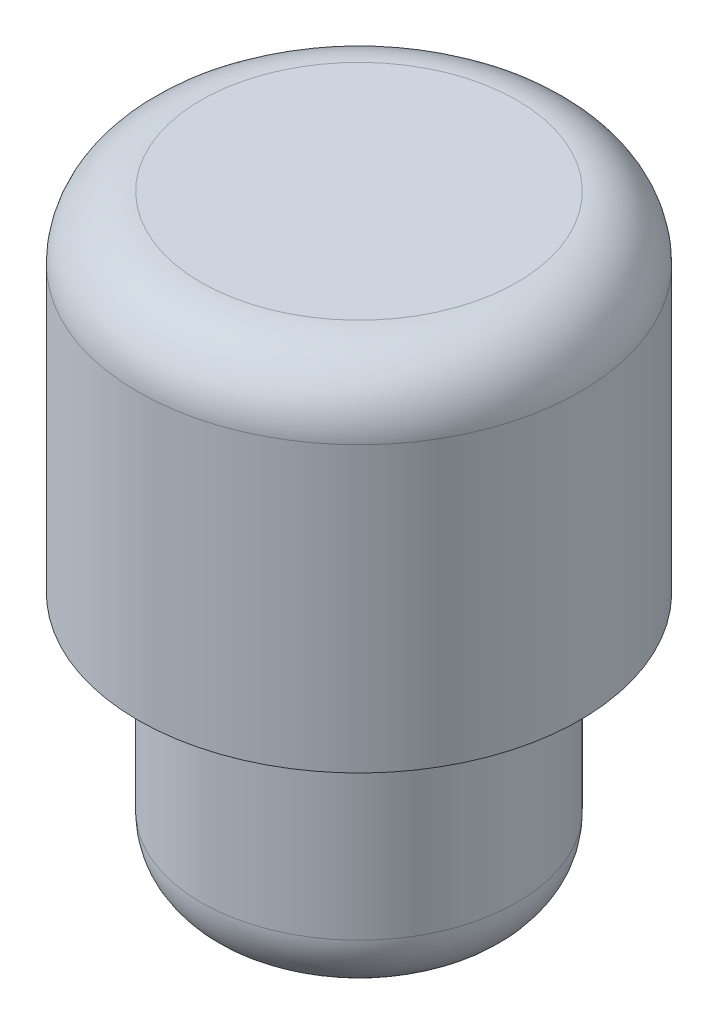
from build123d import *

# Parameters (mm, degrees)
ESQUISSE1_R        = 3.5
BOSS_EXTRU_1_DEPTH = 5.5
CONG_1_R           = 1
ESQUISSE2_R        = 2.5
BOSS_EXTRU_2_DEPTH = 4
CONG_2_R           = 1


with BuildPart() as part:
    # Esquisse1 → Boss.-Extru.1 (new body)
    with BuildSketch(Plane(origin=(0, 0, 0), x_dir=(1, 0, 0), z_dir=(0, 1, 0))):
        with Locations(Location((0, 0, 0), (0, 0, 270))):
            Circle(ESQUISSE1_R)
    extrude(amount=BOSS_EXTRU_1_DEPTH)

    # Cong_1
    cong_1_edges = [part.edges().sort_by_distance(p)[0] for p in [
        (0, 5.5, -3.5),
    ]]
    fillet(cong_1_edges, radius=CONG_1_R)

    # Esquisse2 → Boss.-Extru.2 (add)
    with BuildSketch(Plane.XZ):
        with Locations(Location((0, 0, 0), (0, 0, 90))):
            Circle(ESQUISSE2_R)
    extrude(amount=BOSS_EXTRU_2_DEPTH)

    # Cong_2
    cong_2_edges = [part.edges().sort_by_distance(p)[0] for p in [
        (0, -4, -2.5),
    ]]
    fillet(cong_2_edges, radius=CONG_2_R)


solid = part.part
